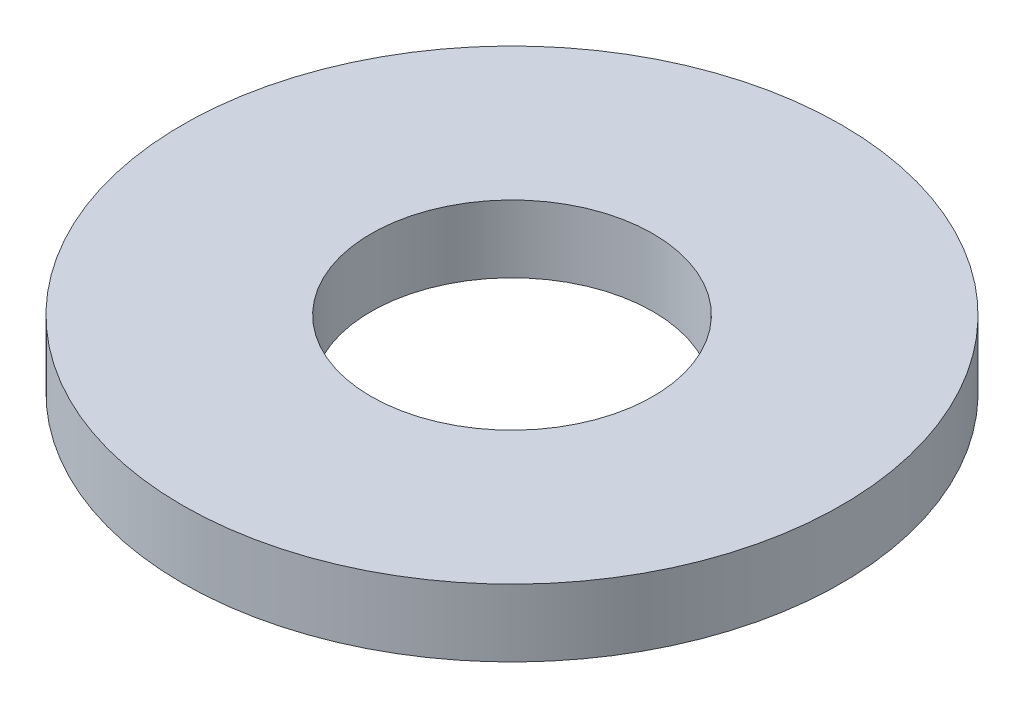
ISO-10303-21;
HEADER;
FILE_DESCRIPTION(('STEP AP214'),'2;1');
FILE_NAME('part.step','',(''),(''),'','','');
FILE_SCHEMA(('AUTOMOTIVE_DESIGN { 1 0 10303 214 1 1 1 1 }'));
ENDSEC;
DATA;
#1=APPLICATION_CONTEXT('core data for automotive mechanical design processes');
#2=APPLICATION_PROTOCOL_DEFINITION('international standard','automotive_design',2000,#1);
#3=PRODUCT_CONTEXT('',#1,'mechanical');
#4=PRODUCT('Part','Part','',(#3));
#5=PRODUCT_RELATED_PRODUCT_CATEGORY('part','',(#4));
#6=PRODUCT_DEFINITION_FORMATION('','',#4);
#7=PRODUCT_DEFINITION_CONTEXT('part definition',#1,'design');
#8=PRODUCT_DEFINITION('design','',#6,#7);
#9=PRODUCT_DEFINITION_SHAPE('','',#8);
#10=(LENGTH_UNIT() NAMED_UNIT(*) SI_UNIT(.MILLI.,.METRE.));
#11=(NAMED_UNIT(*) PLANE_ANGLE_UNIT() SI_UNIT($,.RADIAN.));
#12=(NAMED_UNIT(*) SI_UNIT($,.STERADIAN.) SOLID_ANGLE_UNIT());
#13=UNCERTAINTY_MEASURE_WITH_UNIT(LENGTH_MEASURE(1.E-05),#10,'distance_accuracy_value','');
#14=(GEOMETRIC_REPRESENTATION_CONTEXT(3) GLOBAL_UNCERTAINTY_ASSIGNED_CONTEXT((#13)) GLOBAL_UNIT_ASSIGNED_CONTEXT((#10,
#11,#12)) REPRESENTATION_CONTEXT('',''));
#15=CARTESIAN_POINT('',(0.,0.,0.));
#16=DIRECTION('',(0.,0.,1.));
#17=DIRECTION('',(1.,0.,0.));
#18=AXIS2_PLACEMENT_3D('',#15,#16,#17);
#19=CARTESIAN_POINT('',(0.,0.,0.));
#20=DIRECTION('',(0.,-1.,0.));
#21=DIRECTION('',(0.,0.,-1.));
#22=AXIS2_PLACEMENT_3D('',#19,#20,#21);
#23=CYLINDRICAL_SURFACE('',#22,11.7602);
#24=CARTESIAN_POINT('',(0.,0.,0.));
#25=DIRECTION('',(0.,-1.,0.));
#26=DIRECTION('',(0.,0.,-1.));
#27=AXIS2_PLACEMENT_3D('',#24,#25,#26);
#28=CIRCLE('',#27,11.7602);
#29=CARTESIAN_POINT('',(0.,0.,-11.7602));
#30=VERTEX_POINT('',#29);
#31=EDGE_CURVE('E10',#30,#30,#28,.T.);
#32=ORIENTED_EDGE('',*,*,#31,.F.);
#33=EDGE_LOOP('',(#32));
#34=FACE_BOUND('',#33,.T.);
#35=CARTESIAN_POINT('',(0.,1.80574789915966,0.));
#36=DIRECTION('',(0.,-1.,0.));
#37=DIRECTION('',(0.,0.,-1.));
#38=AXIS2_PLACEMENT_3D('',#35,#36,#37);
#39=CIRCLE('',#38,11.7602);
#40=CARTESIAN_POINT('',(0.,1.80574789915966,-11.7602));
#41=VERTEX_POINT('',#40);
#42=EDGE_CURVE('E58',#41,#41,#39,.T.);
#43=ORIENTED_EDGE('',*,*,#42,.T.);
#44=EDGE_LOOP('',(#43));
#45=FACE_BOUND('',#44,.T.);
#46=ADVANCED_FACE('F30',(#34,#45),#23,.T.);
#47=CARTESIAN_POINT('',(-11.7602,0.,0.));
#48=DIRECTION('',(0.,1.,0.));
#49=DIRECTION('',(0.,0.,1.));
#50=AXIS2_PLACEMENT_3D('',#47,#48,#49);
#51=PLANE('',#50);
#52=CARTESIAN_POINT('',(0.,0.,0.));
#53=DIRECTION('',(0.,-1.,0.));
#54=DIRECTION('',(0.,0.,-1.));
#55=AXIS2_PLACEMENT_3D('',#52,#53,#54);
#56=CIRCLE('',#55,9.5631);
#57=CARTESIAN_POINT('',(0.,0.,-9.5631));
#58=VERTEX_POINT('',#57);
#59=EDGE_CURVE('E36',#58,#58,#56,.T.);
#60=ORIENTED_EDGE('',*,*,#59,.F.);
#61=EDGE_LOOP('',(#60));
#62=FACE_BOUND('',#61,.T.);
#63=ORIENTED_EDGE('',*,*,#31,.T.);
#64=EDGE_LOOP('',(#63));
#65=FACE_BOUND('',#64,.T.);
#66=ADVANCED_FACE('F95',(#62,#65),#51,.F.);
#67=CARTESIAN_POINT('',(0.,0.,0.));
#68=DIRECTION('',(0.,-1.,0.));
#69=DIRECTION('',(0.,0.,-1.));
#70=AXIS2_PLACEMENT_3D('',#67,#68,#69);
#71=CYLINDRICAL_SURFACE('',#70,9.5631);
#72=CARTESIAN_POINT('',(0.,4.572,0.));
#73=DIRECTION('',(0.,-1.,0.));
#74=DIRECTION('',(0.,0.,-1.));
#75=AXIS2_PLACEMENT_3D('',#72,#73,#74);
#76=CIRCLE('',#75,9.5631);
#77=CARTESIAN_POINT('',(0.,4.572,-9.5631));
#78=VERTEX_POINT('',#77);
#79=EDGE_CURVE('E40',#78,#78,#76,.T.);
#80=ORIENTED_EDGE('',*,*,#79,.F.);
#81=EDGE_LOOP('',(#80));
#82=FACE_BOUND('',#81,.T.);
#83=ORIENTED_EDGE('',*,*,#59,.T.);
#84=EDGE_LOOP('',(#83));
#85=FACE_BOUND('',#84,.T.);
#86=ADVANCED_FACE('F90',(#82,#85),#71,.F.);
#87=CARTESIAN_POINT('',(-22.352,4.572,0.));
#88=DIRECTION('',(0.,-1.,0.));
#89=DIRECTION('',(0.,0.,-1.));
#90=AXIS2_PLACEMENT_3D('',#87,#88,#89);
#91=PLANE('',#90);
#92=CARTESIAN_POINT('',(0.,4.572,0.));
#93=DIRECTION('',(0.,-1.,0.));
#94=DIRECTION('',(0.,0.,-1.));
#95=AXIS2_PLACEMENT_3D('',#92,#93,#94);
#96=CIRCLE('',#95,22.352);
#97=CARTESIAN_POINT('',(0.,4.572,-22.352));
#98=VERTEX_POINT('',#97);
#99=EDGE_CURVE('E44',#98,#98,#96,.T.);
#100=ORIENTED_EDGE('',*,*,#99,.F.);
#101=EDGE_LOOP('',(#100));
#102=FACE_BOUND('',#101,.T.);
#103=ORIENTED_EDGE('',*,*,#79,.T.);
#104=EDGE_LOOP('',(#103));
#105=FACE_BOUND('',#104,.T.);
#106=ADVANCED_FACE('F84',(#102,#105),#91,.F.);
#107=CARTESIAN_POINT('',(0.,0.,0.));
#108=DIRECTION('',(0.,-1.,0.));
#109=DIRECTION('',(0.,0.,-1.));
#110=AXIS2_PLACEMENT_3D('',#107,#108,#109);
#111=CYLINDRICAL_SURFACE('',#110,22.352);
#112=CARTESIAN_POINT('',(0.,0.,0.));
#113=DIRECTION('',(0.,-1.,0.));
#114=DIRECTION('',(0.,0.,-1.));
#115=AXIS2_PLACEMENT_3D('',#112,#113,#114);
#116=CIRCLE('',#115,22.352);
#117=CARTESIAN_POINT('',(0.,0.,-22.352));
#118=VERTEX_POINT('',#117);
#119=EDGE_CURVE('E49',#118,#118,#116,.T.);
#120=ORIENTED_EDGE('',*,*,#119,.F.);
#121=EDGE_LOOP('',(#120));
#122=FACE_BOUND('',#121,.T.);
#123=ORIENTED_EDGE('',*,*,#99,.T.);
#124=EDGE_LOOP('',(#123));
#125=FACE_BOUND('',#124,.T.);
#126=ADVANCED_FACE('F78',(#122,#125),#111,.T.);
#127=CARTESIAN_POINT('',(-13.9192,0.,0.));
#128=DIRECTION('',(0.,1.,0.));
#129=DIRECTION('',(0.,0.,1.));
#130=AXIS2_PLACEMENT_3D('',#127,#128,#129);
#131=PLANE('',#130);
#132=CARTESIAN_POINT('',(0.,0.,0.));
#133=DIRECTION('',(0.,-1.,0.));
#134=DIRECTION('',(0.,0.,-1.));
#135=AXIS2_PLACEMENT_3D('',#132,#133,#134);
#136=CIRCLE('',#135,13.9192);
#137=CARTESIAN_POINT('',(0.,0.,-13.9192));
#138=VERTEX_POINT('',#137);
#139=EDGE_CURVE('E52',#138,#138,#136,.T.);
#140=ORIENTED_EDGE('',*,*,#139,.F.);
#141=EDGE_LOOP('',(#140));
#142=FACE_BOUND('',#141,.T.);
#143=ORIENTED_EDGE('',*,*,#119,.T.);
#144=EDGE_LOOP('',(#143));
#145=FACE_BOUND('',#144,.T.);
#146=ADVANCED_FACE('F72',(#142,#145),#131,.F.);
#147=CARTESIAN_POINT('',(0.,0.,0.));
#148=DIRECTION('',(0.,-1.,0.));
#149=DIRECTION('',(0.,0.,-1.));
#150=AXIS2_PLACEMENT_3D('',#147,#148,#149);
#151=CYLINDRICAL_SURFACE('',#150,13.9192);
#152=CARTESIAN_POINT('',(0.,1.80574789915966,0.));
#153=DIRECTION('',(0.,-1.,0.));
#154=DIRECTION('',(0.,0.,-1.));
#155=AXIS2_PLACEMENT_3D('',#152,#153,#154);
#156=CIRCLE('',#155,13.9192);
#157=CARTESIAN_POINT('',(0.,1.80574789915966,-13.9192));
#158=VERTEX_POINT('',#157);
#159=EDGE_CURVE('E55',#158,#158,#156,.T.);
#160=ORIENTED_EDGE('',*,*,#159,.F.);
#161=EDGE_LOOP('',(#160));
#162=FACE_BOUND('',#161,.T.);
#163=ORIENTED_EDGE('',*,*,#139,.T.);
#164=EDGE_LOOP('',(#163));
#165=FACE_BOUND('',#164,.T.);
#166=ADVANCED_FACE('F66',(#162,#165),#151,.F.);
#167=CARTESIAN_POINT('',(-11.7602,1.80574789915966,0.));
#168=DIRECTION('',(0.,1.,0.));
#169=DIRECTION('',(0.,0.,1.));
#170=AXIS2_PLACEMENT_3D('',#167,#168,#169);
#171=PLANE('',#170);
#172=ORIENTED_EDGE('',*,*,#42,.F.);
#173=EDGE_LOOP('',(#172));
#174=FACE_BOUND('',#173,.T.);
#175=ORIENTED_EDGE('',*,*,#159,.T.);
#176=EDGE_LOOP('',(#175));
#177=FACE_BOUND('',#176,.T.);
#178=ADVANCED_FACE('F63',(#174,#177),#171,.F.);
#179=CLOSED_SHELL('',(#46,#66,#86,#106,#126,#146,#166,#178));
#180=MANIFOLD_SOLID_BREP('B2',#179);
#181=ADVANCED_BREP_SHAPE_REPRESENTATION('',(#18,#180),#14);
#182=SHAPE_DEFINITION_REPRESENTATION(#9,#181);
ENDSEC;
END-ISO-10303-21;
